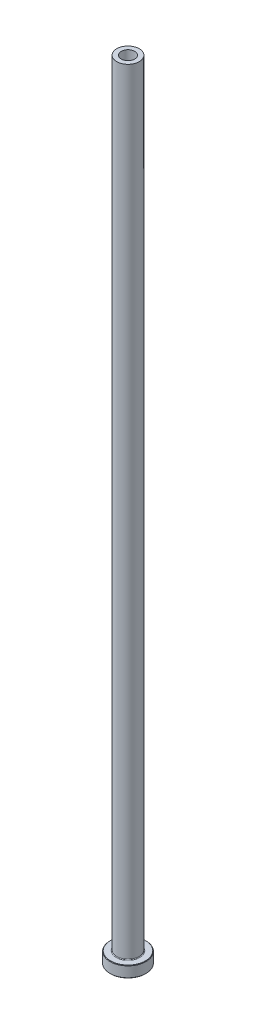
ISO-10303-21;
HEADER;
FILE_DESCRIPTION(('STEP AP214'),'2;1');
FILE_NAME('part.step','',(''),(''),'','','');
FILE_SCHEMA(('AUTOMOTIVE_DESIGN { 1 0 10303 214 1 1 1 1 }'));
ENDSEC;
DATA;
#1=APPLICATION_CONTEXT('core data for automotive mechanical design processes');
#2=APPLICATION_PROTOCOL_DEFINITION('international standard','automotive_design',2000,#1);
#3=PRODUCT_CONTEXT('',#1,'mechanical');
#4=PRODUCT('Part','Part','',(#3));
#5=PRODUCT_RELATED_PRODUCT_CATEGORY('part','',(#4));
#6=PRODUCT_DEFINITION_FORMATION('','',#4);
#7=PRODUCT_DEFINITION_CONTEXT('part definition',#1,'design');
#8=PRODUCT_DEFINITION('design','',#6,#7);
#9=PRODUCT_DEFINITION_SHAPE('','',#8);
#10=(LENGTH_UNIT() NAMED_UNIT(*) SI_UNIT(.MILLI.,.METRE.));
#11=(NAMED_UNIT(*) PLANE_ANGLE_UNIT() SI_UNIT($,.RADIAN.));
#12=(NAMED_UNIT(*) SI_UNIT($,.STERADIAN.) SOLID_ANGLE_UNIT());
#13=UNCERTAINTY_MEASURE_WITH_UNIT(LENGTH_MEASURE(1.E-05),#10,'distance_accuracy_value','');
#14=(GEOMETRIC_REPRESENTATION_CONTEXT(3) GLOBAL_UNCERTAINTY_ASSIGNED_CONTEXT((#13)) GLOBAL_UNIT_ASSIGNED_CONTEXT((#10,
#11,#12)) REPRESENTATION_CONTEXT('',''));
#15=CARTESIAN_POINT('',(0.,0.,0.));
#16=DIRECTION('',(0.,0.,1.));
#17=DIRECTION('',(1.,0.,0.));
#18=AXIS2_PLACEMENT_3D('',#15,#16,#17);
#19=CARTESIAN_POINT('',(0.,92.1876809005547,0.));
#20=DIRECTION('',(0.,1.,0.));
#21=DIRECTION('',(0.,0.,1.));
#22=AXIS2_PLACEMENT_3D('',#19,#20,#21);
#23=CYLINDRICAL_SURFACE('',#22,3.00000000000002);
#24=CARTESIAN_POINT('',(0.,350.,0.));
#25=DIRECTION('',(0.,1.,0.));
#26=DIRECTION('',(0.,0.,1.));
#27=AXIS2_PLACEMENT_3D('',#24,#25,#26);
#28=CIRCLE('',#27,3.00000000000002);
#29=CARTESIAN_POINT('',(0.,350.,3.00000000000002));
#30=VERTEX_POINT('',#29);
#31=EDGE_CURVE('E62',#30,#30,#28,.T.);
#32=ORIENTED_EDGE('',*,*,#31,.T.);
#33=EDGE_LOOP('',(#32));
#34=FACE_BOUND('',#33,.T.);
#35=CARTESIAN_POINT('',(0.,305.,0.));
#36=DIRECTION('',(0.,1.,0.));
#37=DIRECTION('',(0.,0.,1.));
#38=AXIS2_PLACEMENT_3D('',#35,#36,#37);
#39=CIRCLE('',#38,3.00000000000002);
#40=CARTESIAN_POINT('',(0.,305.,3.00000000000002));
#41=VERTEX_POINT('',#40);
#42=EDGE_CURVE('E71',#41,#41,#39,.T.);
#43=ORIENTED_EDGE('',*,*,#42,.F.);
#44=EDGE_LOOP('',(#43));
#45=FACE_BOUND('',#44,.T.);
#46=ADVANCED_FACE('F30',(#34,#45),#23,.F.);
#47=CARTESIAN_POINT('',(-3.00000000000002,350.,0.));
#48=DIRECTION('',(0.,1.,0.));
#49=DIRECTION('',(0.,0.,1.));
#50=AXIS2_PLACEMENT_3D('',#47,#48,#49);
#51=PLANE('',#50);
#52=CARTESIAN_POINT('',(0.,350.,0.));
#53=DIRECTION('',(0.,1.,0.));
#54=DIRECTION('',(0.,0.,1.));
#55=AXIS2_PLACEMENT_3D('',#52,#53,#54);
#56=CIRCLE('',#55,5.00000000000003);
#57=CARTESIAN_POINT('',(0.,350.,5.00000000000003));
#58=VERTEX_POINT('',#57);
#59=EDGE_CURVE('E65',#58,#58,#56,.T.);
#60=ORIENTED_EDGE('',*,*,#59,.T.);
#61=EDGE_LOOP('',(#60));
#62=FACE_BOUND('',#61,.T.);
#63=ORIENTED_EDGE('',*,*,#31,.F.);
#64=EDGE_LOOP('',(#63));
#65=FACE_BOUND('',#64,.T.);
#66=ADVANCED_FACE('F79',(#62,#65),#51,.T.);
#67=CARTESIAN_POINT('',(0.,92.1876809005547,0.));
#68=DIRECTION('',(0.,1.,0.));
#69=DIRECTION('',(0.,0.,1.));
#70=AXIS2_PLACEMENT_3D('',#67,#68,#69);
#71=CYLINDRICAL_SURFACE('',#70,5.00000000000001);
#72=CARTESIAN_POINT('',(0.,5.3,0.));
#73=DIRECTION('',(0.,1.,0.));
#74=DIRECTION('',(0.,0.,1.));
#75=AXIS2_PLACEMENT_3D('',#72,#73,#74);
#76=CIRCLE('',#75,5.00000000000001);
#77=CARTESIAN_POINT('',(0.,5.3,5.00000000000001));
#78=VERTEX_POINT('',#77);
#79=EDGE_CURVE('E59',#78,#78,#76,.T.);
#80=ORIENTED_EDGE('',*,*,#79,.T.);
#81=EDGE_LOOP('',(#80));
#82=FACE_BOUND('',#81,.T.);
#83=ORIENTED_EDGE('',*,*,#59,.F.);
#84=EDGE_LOOP('',(#83));
#85=FACE_BOUND('',#84,.T.);
#86=ADVANCED_FACE('F85',(#82,#85),#71,.T.);
#87=CARTESIAN_POINT('',(-4.99999999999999,5.,0.));
#88=DIRECTION('',(0.,1.,0.));
#89=DIRECTION('',(0.,0.,1.));
#90=AXIS2_PLACEMENT_3D('',#87,#88,#89);
#91=PLANE('',#90);
#92=CARTESIAN_POINT('',(0.,5.,0.));
#93=DIRECTION('',(0.,1.,0.));
#94=DIRECTION('',(0.,0.,1.));
#95=AXIS2_PLACEMENT_3D('',#92,#93,#94);
#96=CIRCLE('',#95,7.80000000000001);
#97=CARTESIAN_POINT('',(0.,5.,7.80000000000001));
#98=VERTEX_POINT('',#97);
#99=EDGE_CURVE('E53',#98,#98,#96,.T.);
#100=ORIENTED_EDGE('',*,*,#99,.T.);
#101=EDGE_LOOP('',(#100));
#102=FACE_BOUND('',#101,.T.);
#103=CARTESIAN_POINT('',(0.,5.,0.));
#104=DIRECTION('',(0.,1.,0.));
#105=DIRECTION('',(0.,0.,1.));
#106=AXIS2_PLACEMENT_3D('',#103,#104,#105);
#107=CIRCLE('',#106,5.30000000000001);
#108=CARTESIAN_POINT('',(0.,5.,5.30000000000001));
#109=VERTEX_POINT('',#108);
#110=EDGE_CURVE('E56',#109,#109,#107,.F.);
#111=ORIENTED_EDGE('',*,*,#110,.T.);
#112=EDGE_LOOP('',(#111));
#113=FACE_BOUND('',#112,.T.);
#114=ADVANCED_FACE('F111',(#102,#113),#91,.T.);
#115=CARTESIAN_POINT('',(0.,92.1876809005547,0.));
#116=DIRECTION('',(0.,1.,0.));
#117=DIRECTION('',(0.,0.,1.));
#118=AXIS2_PLACEMENT_3D('',#115,#116,#117);
#119=CYLINDRICAL_SURFACE('',#118,7.99999999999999);
#120=CARTESIAN_POINT('',(0.,4.80000000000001,0.));
#121=DIRECTION('',(0.,1.,0.));
#122=DIRECTION('',(0.,0.,1.));
#123=AXIS2_PLACEMENT_3D('',#120,#121,#122);
#124=CIRCLE('',#123,7.99999999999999);
#125=CARTESIAN_POINT('',(0.,4.80000000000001,7.99999999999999));
#126=VERTEX_POINT('',#125);
#127=EDGE_CURVE('E45',#126,#126,#124,.F.);
#128=ORIENTED_EDGE('',*,*,#127,.T.);
#129=EDGE_LOOP('',(#128));
#130=FACE_BOUND('',#129,.T.);
#131=CARTESIAN_POINT('',(0.,0.20000000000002,0.));
#132=DIRECTION('',(0.,-1.,0.));
#133=DIRECTION('',(0.,0.,-1.));
#134=AXIS2_PLACEMENT_3D('',#131,#132,#133);
#135=CIRCLE('',#134,7.99999999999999);
#136=CARTESIAN_POINT('',(0.,0.20000000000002,-7.99999999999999));
#137=VERTEX_POINT('',#136);
#138=EDGE_CURVE('E50',#137,#137,#135,.F.);
#139=ORIENTED_EDGE('',*,*,#138,.T.);
#140=EDGE_LOOP('',(#139));
#141=FACE_BOUND('',#140,.T.);
#142=ADVANCED_FACE('F108',(#130,#141),#119,.T.);
#143=CARTESIAN_POINT('',(-7.99999999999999,0.,0.));
#144=DIRECTION('',(0.,-1.,0.));
#145=DIRECTION('',(0.,0.,-1.));
#146=AXIS2_PLACEMENT_3D('',#143,#144,#145);
#147=PLANE('',#146);
#148=CARTESIAN_POINT('',(0.,0.,0.));
#149=DIRECTION('',(0.,-1.,0.));
#150=DIRECTION('',(0.,0.,-1.));
#151=AXIS2_PLACEMENT_3D('',#148,#149,#150);
#152=CIRCLE('',#151,3.75);
#153=CARTESIAN_POINT('',(0.,0.,-3.75));
#154=VERTEX_POINT('',#153);
#155=EDGE_CURVE('E37',#154,#154,#152,.F.);
#156=ORIENTED_EDGE('',*,*,#155,.T.);
#157=EDGE_LOOP('',(#156));
#158=FACE_BOUND('',#157,.T.);
#159=CARTESIAN_POINT('',(0.,0.,0.));
#160=DIRECTION('',(0.,-1.,0.));
#161=DIRECTION('',(0.,0.,-1.));
#162=AXIS2_PLACEMENT_3D('',#159,#160,#161);
#163=CIRCLE('',#162,7.79999999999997);
#164=CARTESIAN_POINT('',(0.,0.,-7.79999999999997));
#165=VERTEX_POINT('',#164);
#166=EDGE_CURVE('E41',#165,#165,#163,.T.);
#167=ORIENTED_EDGE('',*,*,#166,.T.);
#168=EDGE_LOOP('',(#167));
#169=FACE_BOUND('',#168,.T.);
#170=ADVANCED_FACE('F110',(#158,#169),#147,.T.);
#171=CARTESIAN_POINT('',(0.,92.1876809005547,0.));
#172=DIRECTION('',(0.,1.,0.));
#173=DIRECTION('',(0.,0.,1.));
#174=AXIS2_PLACEMENT_3D('',#171,#172,#173);
#175=CYLINDRICAL_SURFACE('',#174,3.25000000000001);
#176=CARTESIAN_POINT('',(0.,0.499999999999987,0.));
#177=DIRECTION('',(0.,-1.,0.));
#178=DIRECTION('',(0.,0.,-1.));
#179=AXIS2_PLACEMENT_3D('',#176,#177,#178);
#180=CIRCLE('',#179,3.25000000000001);
#181=CARTESIAN_POINT('',(0.,0.499999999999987,-3.25000000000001));
#182=VERTEX_POINT('',#181);
#183=EDGE_CURVE('E10',#182,#182,#180,.T.);
#184=ORIENTED_EDGE('',*,*,#183,.T.);
#185=EDGE_LOOP('',(#184));
#186=FACE_BOUND('',#185,.T.);
#187=CARTESIAN_POINT('',(0.,293.,0.));
#188=DIRECTION('',(0.,1.,0.));
#189=DIRECTION('',(0.,0.,1.));
#190=AXIS2_PLACEMENT_3D('',#187,#188,#189);
#191=CIRCLE('',#190,3.25000000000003);
#192=CARTESIAN_POINT('',(0.,293.,3.25000000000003));
#193=VERTEX_POINT('',#192);
#194=EDGE_CURVE('E68',#193,#193,#191,.T.);
#195=ORIENTED_EDGE('',*,*,#194,.T.);
#196=EDGE_LOOP('',(#195));
#197=FACE_BOUND('',#196,.T.);
#198=ADVANCED_FACE('F118',(#186,#197),#175,.F.);
#199=CARTESIAN_POINT('',(0.,293.,0.));
#200=DIRECTION('',(0.,-1.,0.));
#201=DIRECTION('',(0.,0.,-1.));
#202=AXIS2_PLACEMENT_3D('',#199,#200,#201);
#203=CONICAL_SURFACE('',#202,3.25000000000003,0.0208303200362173);
#204=ORIENTED_EDGE('',*,*,#42,.T.);
#205=EDGE_LOOP('',(#204));
#206=FACE_BOUND('',#205,.T.);
#207=ORIENTED_EDGE('',*,*,#194,.F.);
#208=EDGE_LOOP('',(#207));
#209=FACE_BOUND('',#208,.T.);
#210=ADVANCED_FACE('F75',(#206,#209),#203,.F.);
#211=CARTESIAN_POINT('',(0.,5.3,0.));
#212=DIRECTION('',(0.,1.,0.));
#213=DIRECTION('',(0.,0.,1.));
#214=AXIS2_PLACEMENT_3D('',#211,#212,#213);
#215=TOROIDAL_SURFACE('',#214,5.30000000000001,0.3);
#216=ORIENTED_EDGE('',*,*,#110,.F.);
#217=EDGE_LOOP('',(#216));
#218=FACE_BOUND('',#217,.T.);
#219=ORIENTED_EDGE('',*,*,#79,.F.);
#220=EDGE_LOOP('',(#219));
#221=FACE_BOUND('',#220,.T.);
#222=ADVANCED_FACE('F90',(#218,#221),#215,.F.);
#223=CARTESIAN_POINT('',(0.,5.,0.));
#224=DIRECTION('',(0.,-1.,0.));
#225=DIRECTION('',(0.,0.,-1.));
#226=AXIS2_PLACEMENT_3D('',#223,#224,#225);
#227=CONICAL_SURFACE('',#226,7.8,0.78539816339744);
#228=ORIENTED_EDGE('',*,*,#127,.F.);
#229=EDGE_LOOP('',(#228));
#230=FACE_BOUND('',#229,.T.);
#231=ORIENTED_EDGE('',*,*,#99,.F.);
#232=EDGE_LOOP('',(#231));
#233=FACE_BOUND('',#232,.T.);
#234=ADVANCED_FACE('F93',(#230,#233),#227,.T.);
#235=CARTESIAN_POINT('',(0.,0.20000000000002,0.));
#236=DIRECTION('',(0.,1.,0.));
#237=DIRECTION('',(0.,0.,1.));
#238=AXIS2_PLACEMENT_3D('',#235,#236,#237);
#239=CONICAL_SURFACE('',#238,7.99999999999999,0.78539816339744);
#240=ORIENTED_EDGE('',*,*,#166,.F.);
#241=EDGE_LOOP('',(#240));
#242=FACE_BOUND('',#241,.T.);
#243=ORIENTED_EDGE('',*,*,#138,.F.);
#244=EDGE_LOOP('',(#243));
#245=FACE_BOUND('',#244,.T.);
#246=ADVANCED_FACE('F96',(#242,#245),#239,.T.);
#247=CARTESIAN_POINT('',(0.,0.,0.));
#248=DIRECTION('',(0.,-1.,0.));
#249=DIRECTION('',(0.,0.,-1.));
#250=AXIS2_PLACEMENT_3D('',#247,#248,#249);
#251=CONICAL_SURFACE('',#250,3.75,0.785398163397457);
#252=ORIENTED_EDGE('',*,*,#183,.F.);
#253=EDGE_LOOP('',(#252));
#254=FACE_BOUND('',#253,.T.);
#255=ORIENTED_EDGE('',*,*,#155,.F.);
#256=EDGE_LOOP('',(#255));
#257=FACE_BOUND('',#256,.T.);
#258=ADVANCED_FACE('F32',(#254,#257),#251,.F.);
#259=CLOSED_SHELL('',(#46,#66,#86,#114,#142,#170,#198,#210,#222,#234,#246,#258));
#260=MANIFOLD_SOLID_BREP('B2',#259);
#261=ADVANCED_BREP_SHAPE_REPRESENTATION('',(#18,#260),#14);
#262=SHAPE_DEFINITION_REPRESENTATION(#9,#261);
ENDSEC;
END-ISO-10303-21;
